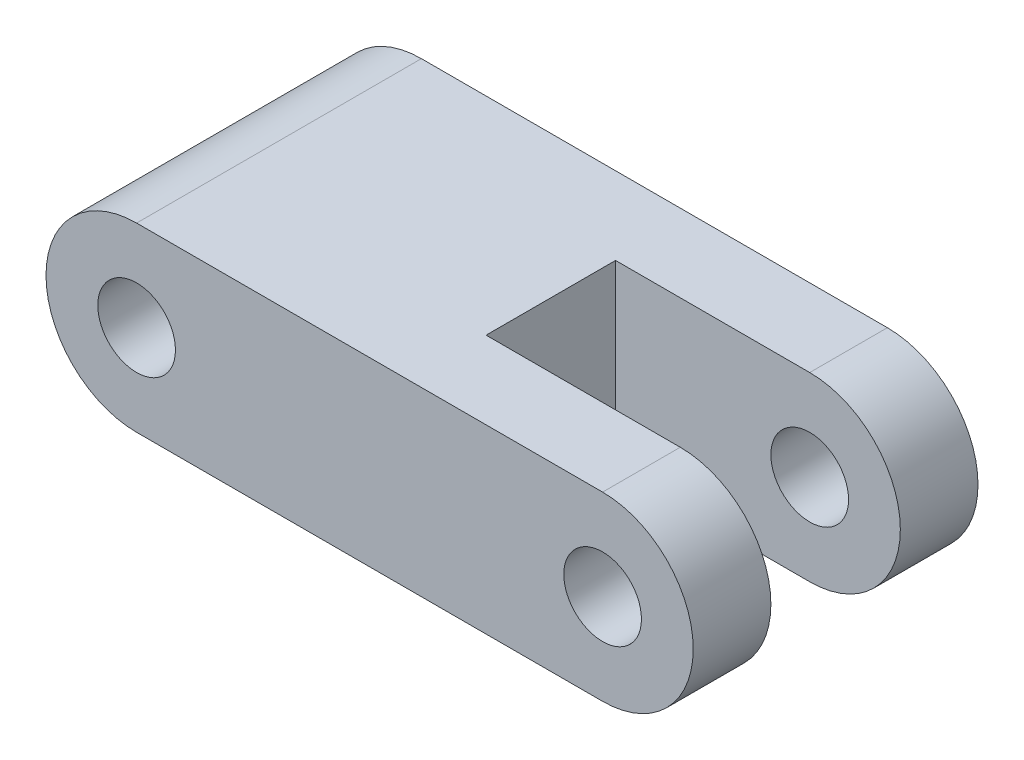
ISO-10303-21;
HEADER;
FILE_DESCRIPTION(('STEP AP214'),'2;1');
FILE_NAME('part.step','',(''),(''),'','','');
FILE_SCHEMA(('AUTOMOTIVE_DESIGN { 1 0 10303 214 1 1 1 1 }'));
ENDSEC;
DATA;
#1=APPLICATION_CONTEXT('core data for automotive mechanical design processes');
#2=APPLICATION_PROTOCOL_DEFINITION('international standard','automotive_design',2000,#1);
#3=PRODUCT_CONTEXT('',#1,'mechanical');
#4=PRODUCT('Part','Part','',(#3));
#5=PRODUCT_RELATED_PRODUCT_CATEGORY('part','',(#4));
#6=PRODUCT_DEFINITION_FORMATION('','',#4);
#7=PRODUCT_DEFINITION_CONTEXT('part definition',#1,'design');
#8=PRODUCT_DEFINITION('design','',#6,#7);
#9=PRODUCT_DEFINITION_SHAPE('','',#8);
#10=(LENGTH_UNIT() NAMED_UNIT(*) SI_UNIT(.MILLI.,.METRE.));
#11=(NAMED_UNIT(*) PLANE_ANGLE_UNIT() SI_UNIT($,.RADIAN.));
#12=(NAMED_UNIT(*) SI_UNIT($,.STERADIAN.) SOLID_ANGLE_UNIT());
#13=UNCERTAINTY_MEASURE_WITH_UNIT(LENGTH_MEASURE(1.E-05),#10,'distance_accuracy_value','');
#14=(GEOMETRIC_REPRESENTATION_CONTEXT(3) GLOBAL_UNCERTAINTY_ASSIGNED_CONTEXT((#13)) GLOBAL_UNIT_ASSIGNED_CONTEXT((#10,
#11,#12)) REPRESENTATION_CONTEXT('',''));
#15=CARTESIAN_POINT('',(0.,0.,0.));
#16=DIRECTION('',(0.,0.,1.));
#17=DIRECTION('',(1.,0.,0.));
#18=AXIS2_PLACEMENT_3D('',#15,#16,#17);
#19=CARTESIAN_POINT('',(36.,0.,11.));
#20=DIRECTION('',(0.,0.,-1.));
#21=DIRECTION('',(-1.,0.,0.));
#22=AXIS2_PLACEMENT_3D('',#19,#20,#21);
#23=CYLINDRICAL_SURFACE('',#22,7.);
#24=CARTESIAN_POINT('',(36.,0.,4.99999999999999));
#25=DIRECTION('',(0.,0.,1.));
#26=DIRECTION('',(1.,0.,0.));
#27=AXIS2_PLACEMENT_3D('',#24,#25,#26);
#28=CIRCLE('',#27,7.);
#29=CARTESIAN_POINT('',(36.,-7.,4.99999999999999));
#30=VERTEX_POINT('',#29);
#31=CARTESIAN_POINT('',(36.,7.,4.99999999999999));
#32=VERTEX_POINT('',#31);
#33=EDGE_CURVE('E132',#30,#32,#28,.T.);
#34=ORIENTED_EDGE('',*,*,#33,.T.);
#35=DIRECTION('',(0.,0.,-1.));
#36=VECTOR('',#35,1.);
#37=CARTESIAN_POINT('',(36.,7.,11.));
#38=LINE('',#37,#36);
#39=CARTESIAN_POINT('',(36.,7.,11.));
#40=VERTEX_POINT('',#39);
#41=EDGE_CURVE('E11',#40,#32,#38,.T.);
#42=ORIENTED_EDGE('',*,*,#41,.F.);
#43=CARTESIAN_POINT('',(36.,0.,11.));
#44=DIRECTION('',(0.,0.,1.));
#45=DIRECTION('',(1.,0.,0.));
#46=AXIS2_PLACEMENT_3D('',#43,#44,#45);
#47=CIRCLE('',#46,7.);
#48=CARTESIAN_POINT('',(36.,-7.,11.));
#49=VERTEX_POINT('',#48);
#50=EDGE_CURVE('E156',#49,#40,#47,.T.);
#51=ORIENTED_EDGE('',*,*,#50,.F.);
#52=DIRECTION('',(0.,0.,-1.));
#53=VECTOR('',#52,1.);
#54=CARTESIAN_POINT('',(36.,-7.,11.));
#55=LINE('',#54,#53);
#56=EDGE_CURVE('E164',#49,#30,#55,.T.);
#57=ORIENTED_EDGE('',*,*,#56,.T.);
#58=EDGE_LOOP('',(#34,#42,#51,#57));
#59=FACE_BOUND('',#58,.T.);
#60=ADVANCED_FACE('F33',(#59),#23,.T.);
#61=CARTESIAN_POINT('',(36.,0.,11.));
#62=DIRECTION('',(0.,0.,1.));
#63=DIRECTION('',(1.,0.,0.));
#64=AXIS2_PLACEMENT_3D('',#61,#62,#63);
#65=CYLINDRICAL_SURFACE('',#64,2.99999999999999);
#66=CARTESIAN_POINT('',(36.,0.,4.99999999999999));
#67=DIRECTION('',(0.,0.,1.));
#68=DIRECTION('',(1.,0.,0.));
#69=AXIS2_PLACEMENT_3D('',#66,#67,#68);
#70=CIRCLE('',#69,2.99999999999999);
#71=CARTESIAN_POINT('',(39.,0.,4.99999999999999));
#72=VERTEX_POINT('',#71);
#73=EDGE_CURVE('E37',#72,#72,#70,.F.);
#74=ORIENTED_EDGE('',*,*,#73,.T.);
#75=EDGE_LOOP('',(#74));
#76=FACE_BOUND('',#75,.T.);
#77=CARTESIAN_POINT('',(36.,0.,11.));
#78=DIRECTION('',(0.,0.,1.));
#79=DIRECTION('',(1.,0.,0.));
#80=AXIS2_PLACEMENT_3D('',#77,#78,#79);
#81=CIRCLE('',#80,2.99999999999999);
#82=CARTESIAN_POINT('',(39.,0.,11.));
#83=VERTEX_POINT('',#82);
#84=EDGE_CURVE('E137',#83,#83,#81,.T.);
#85=ORIENTED_EDGE('',*,*,#84,.T.);
#86=EDGE_LOOP('',(#85));
#87=FACE_BOUND('',#86,.T.);
#88=ADVANCED_FACE('F190',(#76,#87),#65,.F.);
#89=CARTESIAN_POINT('',(36.,7.,-5.));
#90=VERTEX_POINT('',#89);
#91=CARTESIAN_POINT('',(36.,7.,-11.));
#92=VERTEX_POINT('',#91);
#93=EDGE_CURVE('E42',#90,#92,#38,.T.);
#94=ORIENTED_EDGE('',*,*,#93,.F.);
#95=CARTESIAN_POINT('',(36.,0.,-5.));
#96=DIRECTION('',(0.,0.,-1.));
#97=DIRECTION('',(-1.,0.,0.));
#98=AXIS2_PLACEMENT_3D('',#95,#96,#97);
#99=CIRCLE('',#98,7.);
#100=CARTESIAN_POINT('',(36.,-7.,-5.));
#101=VERTEX_POINT('',#100);
#102=EDGE_CURVE('E106',#90,#101,#99,.T.);
#103=ORIENTED_EDGE('',*,*,#102,.T.);
#104=CARTESIAN_POINT('',(36.,-7.,-11.));
#105=VERTEX_POINT('',#104);
#106=EDGE_CURVE('E163',#101,#105,#55,.T.);
#107=ORIENTED_EDGE('',*,*,#106,.T.);
#108=CARTESIAN_POINT('',(36.,0.,-11.));
#109=DIRECTION('',(0.,0.,1.));
#110=DIRECTION('',(1.,0.,0.));
#111=AXIS2_PLACEMENT_3D('',#108,#109,#110);
#112=CIRCLE('',#111,7.);
#113=EDGE_CURVE('E146',#105,#92,#112,.T.);
#114=ORIENTED_EDGE('',*,*,#113,.T.);
#115=EDGE_LOOP('',(#94,#103,#107,#114));
#116=FACE_BOUND('',#115,.T.);
#117=ADVANCED_FACE('F35',(#116),#23,.T.);
#118=CARTESIAN_POINT('',(0.,7.,11.));
#119=DIRECTION('',(0.,-1.,0.));
#120=DIRECTION('',(0.,0.,-1.));
#121=AXIS2_PLACEMENT_3D('',#118,#119,#120);
#122=PLANE('',#121);
#123=ORIENTED_EDGE('',*,*,#41,.T.);
#124=DIRECTION('',(1.,0.,0.));
#125=VECTOR('',#124,1.);
#126=CARTESIAN_POINT('',(43.,7.,4.99999999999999));
#127=LINE('',#126,#125);
#128=CARTESIAN_POINT('',(21.,7.,5.));
#129=VERTEX_POINT('',#128);
#130=EDGE_CURVE('E120',#129,#32,#127,.T.);
#131=ORIENTED_EDGE('',*,*,#130,.F.);
#132=DIRECTION('',(0.,0.,1.));
#133=VECTOR('',#132,1.);
#134=CARTESIAN_POINT('',(21.,7.,-5.));
#135=LINE('',#134,#133);
#136=CARTESIAN_POINT('',(21.,7.,-5.));
#137=VERTEX_POINT('',#136);
#138=EDGE_CURVE('E110',#137,#129,#135,.T.);
#139=ORIENTED_EDGE('',*,*,#138,.F.);
#140=DIRECTION('',(-1.,0.,0.));
#141=VECTOR('',#140,1.);
#142=CARTESIAN_POINT('',(43.,7.,-5.00000000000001));
#143=LINE('',#142,#141);
#144=EDGE_CURVE('E101',#90,#137,#143,.T.);
#145=ORIENTED_EDGE('',*,*,#144,.F.);
#146=ORIENTED_EDGE('',*,*,#93,.T.);
#147=DIRECTION('',(-1.,0.,0.));
#148=VECTOR('',#147,1.);
#149=CARTESIAN_POINT('',(0.,7.,-11.));
#150=LINE('',#149,#148);
#151=CARTESIAN_POINT('',(0.,7.,-11.));
#152=VERTEX_POINT('',#151);
#153=EDGE_CURVE('E149',#92,#152,#150,.T.);
#154=ORIENTED_EDGE('',*,*,#153,.T.);
#155=DIRECTION('',(0.,0.,-1.));
#156=VECTOR('',#155,1.);
#157=CARTESIAN_POINT('',(0.,7.,11.));
#158=LINE('',#157,#156);
#159=CARTESIAN_POINT('',(0.,7.,11.));
#160=VERTEX_POINT('',#159);
#161=EDGE_CURVE('E170',#160,#152,#158,.T.);
#162=ORIENTED_EDGE('',*,*,#161,.F.);
#163=DIRECTION('',(-1.,0.,0.));
#164=VECTOR('',#163,1.);
#165=CARTESIAN_POINT('',(0.,7.,11.));
#166=LINE('',#165,#164);
#167=EDGE_CURVE('E158',#40,#160,#166,.T.);
#168=ORIENTED_EDGE('',*,*,#167,.F.);
#169=EDGE_LOOP('',(#123,#131,#139,#145,#146,#154,#162,#168));
#170=FACE_BOUND('',#169,.T.);
#171=ADVANCED_FACE('F118',(#170),#122,.F.);
#172=CARTESIAN_POINT('',(0.,0.,11.));
#173=DIRECTION('',(0.,0.,-1.));
#174=DIRECTION('',(-1.,0.,0.));
#175=AXIS2_PLACEMENT_3D('',#172,#173,#174);
#176=CYLINDRICAL_SURFACE('',#175,7.);
#177=CARTESIAN_POINT('',(0.,0.,-11.));
#178=DIRECTION('',(0.,0.,1.));
#179=DIRECTION('',(1.,0.,0.));
#180=AXIS2_PLACEMENT_3D('',#177,#178,#179);
#181=CIRCLE('',#180,7.);
#182=CARTESIAN_POINT('',(0.,-7.,-11.));
#183=VERTEX_POINT('',#182);
#184=EDGE_CURVE('E151',#152,#183,#181,.T.);
#185=ORIENTED_EDGE('',*,*,#184,.T.);
#186=DIRECTION('',(0.,0.,-1.));
#187=VECTOR('',#186,1.);
#188=CARTESIAN_POINT('',(0.,-7.,11.));
#189=LINE('',#188,#187);
#190=CARTESIAN_POINT('',(0.,-7.,11.));
#191=VERTEX_POINT('',#190);
#192=EDGE_CURVE('E167',#191,#183,#189,.T.);
#193=ORIENTED_EDGE('',*,*,#192,.F.);
#194=CARTESIAN_POINT('',(0.,0.,11.));
#195=DIRECTION('',(0.,0.,1.));
#196=DIRECTION('',(1.,0.,0.));
#197=AXIS2_PLACEMENT_3D('',#194,#195,#196);
#198=CIRCLE('',#197,7.);
#199=EDGE_CURVE('E160',#160,#191,#198,.T.);
#200=ORIENTED_EDGE('',*,*,#199,.F.);
#201=ORIENTED_EDGE('',*,*,#161,.T.);
#202=EDGE_LOOP('',(#185,#193,#200,#201));
#203=FACE_BOUND('',#202,.T.);
#204=ADVANCED_FACE('F201',(#203),#176,.T.);
#205=CARTESIAN_POINT('',(0.,-7.,11.));
#206=DIRECTION('',(0.,1.,0.));
#207=DIRECTION('',(0.,0.,1.));
#208=AXIS2_PLACEMENT_3D('',#205,#206,#207);
#209=PLANE('',#208);
#210=DIRECTION('',(0.,0.,1.));
#211=VECTOR('',#210,1.);
#212=CARTESIAN_POINT('',(21.,-7.,-5.));
#213=LINE('',#212,#211);
#214=CARTESIAN_POINT('',(21.,-7.,-5.));
#215=VERTEX_POINT('',#214);
#216=CARTESIAN_POINT('',(21.,-7.,5.));
#217=VERTEX_POINT('',#216);
#218=EDGE_CURVE('E50',#215,#217,#213,.T.);
#219=ORIENTED_EDGE('',*,*,#218,.T.);
#220=DIRECTION('',(1.,0.,0.));
#221=VECTOR('',#220,1.);
#222=CARTESIAN_POINT('',(43.,-7.,4.99999999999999));
#223=LINE('',#222,#221);
#224=EDGE_CURVE('E116',#217,#30,#223,.T.);
#225=ORIENTED_EDGE('',*,*,#224,.T.);
#226=ORIENTED_EDGE('',*,*,#56,.F.);
#227=DIRECTION('',(1.,0.,0.));
#228=VECTOR('',#227,1.);
#229=CARTESIAN_POINT('',(0.,-7.,11.));
#230=LINE('',#229,#228);
#231=EDGE_CURVE('E58',#191,#49,#230,.T.);
#232=ORIENTED_EDGE('',*,*,#231,.F.);
#233=ORIENTED_EDGE('',*,*,#192,.T.);
#234=DIRECTION('',(1.,0.,0.));
#235=VECTOR('',#234,1.);
#236=CARTESIAN_POINT('',(0.,-7.,-11.));
#237=LINE('',#236,#235);
#238=EDGE_CURVE('E153',#183,#105,#237,.T.);
#239=ORIENTED_EDGE('',*,*,#238,.T.);
#240=ORIENTED_EDGE('',*,*,#106,.F.);
#241=DIRECTION('',(-1.,0.,0.));
#242=VECTOR('',#241,1.);
#243=CARTESIAN_POINT('',(43.,-7.,-5.00000000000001));
#244=LINE('',#243,#242);
#245=EDGE_CURVE('E122',#101,#215,#244,.T.);
#246=ORIENTED_EDGE('',*,*,#245,.T.);
#247=EDGE_LOOP('',(#219,#225,#226,#232,#233,#239,#240,#246));
#248=FACE_BOUND('',#247,.T.);
#249=ADVANCED_FACE('F213',(#248),#209,.F.);
#250=CARTESIAN_POINT('',(36.,0.,11.));
#251=DIRECTION('',(0.,0.,1.));
#252=DIRECTION('',(1.,0.,0.));
#253=AXIS2_PLACEMENT_3D('',#250,#251,#252);
#254=PLANE('',#253);
#255=ORIENTED_EDGE('',*,*,#84,.F.);
#256=EDGE_LOOP('',(#255));
#257=FACE_BOUND('',#256,.T.);
#258=CARTESIAN_POINT('',(0.,0.,11.));
#259=DIRECTION('',(0.,0.,1.));
#260=DIRECTION('',(1.,0.,0.));
#261=AXIS2_PLACEMENT_3D('',#258,#259,#260);
#262=CIRCLE('',#261,2.99999999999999);
#263=CARTESIAN_POINT('',(2.99999999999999,0.,11.));
#264=VERTEX_POINT('',#263);
#265=EDGE_CURVE('E143',#264,#264,#262,.T.);
#266=ORIENTED_EDGE('',*,*,#265,.F.);
#267=EDGE_LOOP('',(#266));
#268=FACE_BOUND('',#267,.T.);
#269=ORIENTED_EDGE('',*,*,#50,.T.);
#270=ORIENTED_EDGE('',*,*,#167,.T.);
#271=ORIENTED_EDGE('',*,*,#199,.T.);
#272=ORIENTED_EDGE('',*,*,#231,.T.);
#273=EDGE_LOOP('',(#269,#270,#271,#272));
#274=FACE_BOUND('',#273,.T.);
#275=ADVANCED_FACE('F218',(#257,#268,#274),#254,.T.);
#276=CARTESIAN_POINT('',(36.,0.,-11.));
#277=DIRECTION('',(0.,0.,1.));
#278=DIRECTION('',(1.,0.,0.));
#279=AXIS2_PLACEMENT_3D('',#276,#277,#278);
#280=PLANE('',#279);
#281=CARTESIAN_POINT('',(36.,0.,-11.));
#282=DIRECTION('',(0.,0.,1.));
#283=DIRECTION('',(1.,0.,0.));
#284=AXIS2_PLACEMENT_3D('',#281,#282,#283);
#285=CIRCLE('',#284,3.);
#286=CARTESIAN_POINT('',(39.,0.,-11.));
#287=VERTEX_POINT('',#286);
#288=EDGE_CURVE('E134',#287,#287,#285,.T.);
#289=ORIENTED_EDGE('',*,*,#288,.T.);
#290=EDGE_LOOP('',(#289));
#291=FACE_BOUND('',#290,.T.);
#292=CARTESIAN_POINT('',(0.,0.,-11.));
#293=DIRECTION('',(0.,0.,1.));
#294=DIRECTION('',(1.,0.,0.));
#295=AXIS2_PLACEMENT_3D('',#292,#293,#294);
#296=CIRCLE('',#295,2.99999999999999);
#297=CARTESIAN_POINT('',(2.99999999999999,0.,-11.));
#298=VERTEX_POINT('',#297);
#299=EDGE_CURVE('E140',#298,#298,#296,.T.);
#300=ORIENTED_EDGE('',*,*,#299,.T.);
#301=EDGE_LOOP('',(#300));
#302=FACE_BOUND('',#301,.T.);
#303=ORIENTED_EDGE('',*,*,#113,.F.);
#304=ORIENTED_EDGE('',*,*,#238,.F.);
#305=ORIENTED_EDGE('',*,*,#184,.F.);
#306=ORIENTED_EDGE('',*,*,#153,.F.);
#307=EDGE_LOOP('',(#303,#304,#305,#306));
#308=FACE_BOUND('',#307,.T.);
#309=ADVANCED_FACE('F207',(#291,#302,#308),#280,.F.);
#310=CARTESIAN_POINT('',(0.,0.,11.));
#311=DIRECTION('',(0.,0.,1.));
#312=DIRECTION('',(1.,0.,0.));
#313=AXIS2_PLACEMENT_3D('',#310,#311,#312);
#314=CYLINDRICAL_SURFACE('',#313,2.99999999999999);
#315=ORIENTED_EDGE('',*,*,#299,.F.);
#316=EDGE_LOOP('',(#315));
#317=FACE_BOUND('',#316,.T.);
#318=ORIENTED_EDGE('',*,*,#265,.T.);
#319=EDGE_LOOP('',(#318));
#320=FACE_BOUND('',#319,.T.);
#321=ADVANCED_FACE('F226',(#317,#320),#314,.F.);
#322=CARTESIAN_POINT('',(36.,0.,-5.));
#323=DIRECTION('',(0.,0.,-1.));
#324=DIRECTION('',(-1.,0.,0.));
#325=AXIS2_PLACEMENT_3D('',#322,#323,#324);
#326=CIRCLE('',#325,2.99999999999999);
#327=CARTESIAN_POINT('',(33.,0.,-5.));
#328=VERTEX_POINT('',#327);
#329=EDGE_CURVE('E129',#328,#328,#326,.F.);
#330=ORIENTED_EDGE('',*,*,#329,.T.);
#331=EDGE_LOOP('',(#330));
#332=FACE_BOUND('',#331,.T.);
#333=ORIENTED_EDGE('',*,*,#288,.F.);
#334=EDGE_LOOP('',(#333));
#335=FACE_BOUND('',#334,.T.);
#336=ADVANCED_FACE('F175',(#332,#335),#65,.F.);
#337=CARTESIAN_POINT('',(43.,-7.,4.99999999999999));
#338=DIRECTION('',(0.,0.,1.));
#339=DIRECTION('',(1.,0.,0.));
#340=AXIS2_PLACEMENT_3D('',#337,#338,#339);
#341=PLANE('',#340);
#342=ORIENTED_EDGE('',*,*,#73,.F.);
#343=EDGE_LOOP('',(#342));
#344=FACE_BOUND('',#343,.T.);
#345=ORIENTED_EDGE('',*,*,#33,.F.);
#346=ORIENTED_EDGE('',*,*,#224,.F.);
#347=DIRECTION('',(0.,1.,0.));
#348=VECTOR('',#347,1.);
#349=CARTESIAN_POINT('',(21.,-7.,5.));
#350=LINE('',#349,#348);
#351=EDGE_CURVE('E115',#217,#129,#350,.T.);
#352=ORIENTED_EDGE('',*,*,#351,.T.);
#353=ORIENTED_EDGE('',*,*,#130,.T.);
#354=EDGE_LOOP('',(#345,#346,#352,#353));
#355=FACE_BOUND('',#354,.T.);
#356=ADVANCED_FACE('F179',(#344,#355),#341,.F.);
#357=CARTESIAN_POINT('',(43.,-7.,-5.00000000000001));
#358=DIRECTION('',(0.,0.,-1.));
#359=DIRECTION('',(-1.,0.,0.));
#360=AXIS2_PLACEMENT_3D('',#357,#358,#359);
#361=PLANE('',#360);
#362=ORIENTED_EDGE('',*,*,#329,.F.);
#363=EDGE_LOOP('',(#362));
#364=FACE_BOUND('',#363,.T.);
#365=ORIENTED_EDGE('',*,*,#144,.T.);
#366=DIRECTION('',(0.,1.,0.));
#367=VECTOR('',#366,1.);
#368=CARTESIAN_POINT('',(21.,-7.,-5.));
#369=LINE('',#368,#367);
#370=EDGE_CURVE('E104',#215,#137,#369,.T.);
#371=ORIENTED_EDGE('',*,*,#370,.F.);
#372=ORIENTED_EDGE('',*,*,#245,.F.);
#373=ORIENTED_EDGE('',*,*,#102,.F.);
#374=EDGE_LOOP('',(#365,#371,#372,#373));
#375=FACE_BOUND('',#374,.T.);
#376=ADVANCED_FACE('F102',(#364,#375),#361,.F.);
#377=CARTESIAN_POINT('',(21.,-7.,-5.));
#378=DIRECTION('',(-1.,0.,0.));
#379=DIRECTION('',(0.,0.,1.));
#380=AXIS2_PLACEMENT_3D('',#377,#378,#379);
#381=PLANE('',#380);
#382=ORIENTED_EDGE('',*,*,#138,.T.);
#383=ORIENTED_EDGE('',*,*,#351,.F.);
#384=ORIENTED_EDGE('',*,*,#218,.F.);
#385=ORIENTED_EDGE('',*,*,#370,.T.);
#386=EDGE_LOOP('',(#382,#383,#384,#385));
#387=FACE_BOUND('',#386,.T.);
#388=ADVANCED_FACE('F113',(#387),#381,.F.);
#389=CLOSED_SHELL('',(#60,#88,#117,#171,#204,#249,#275,#309,#321,#336,#356,#376,#388));
#390=MANIFOLD_SOLID_BREP('B2',#389);
#391=ADVANCED_BREP_SHAPE_REPRESENTATION('',(#18,#390),#14);
#392=SHAPE_DEFINITION_REPRESENTATION(#9,#391);
ENDSEC;
END-ISO-10303-21;
